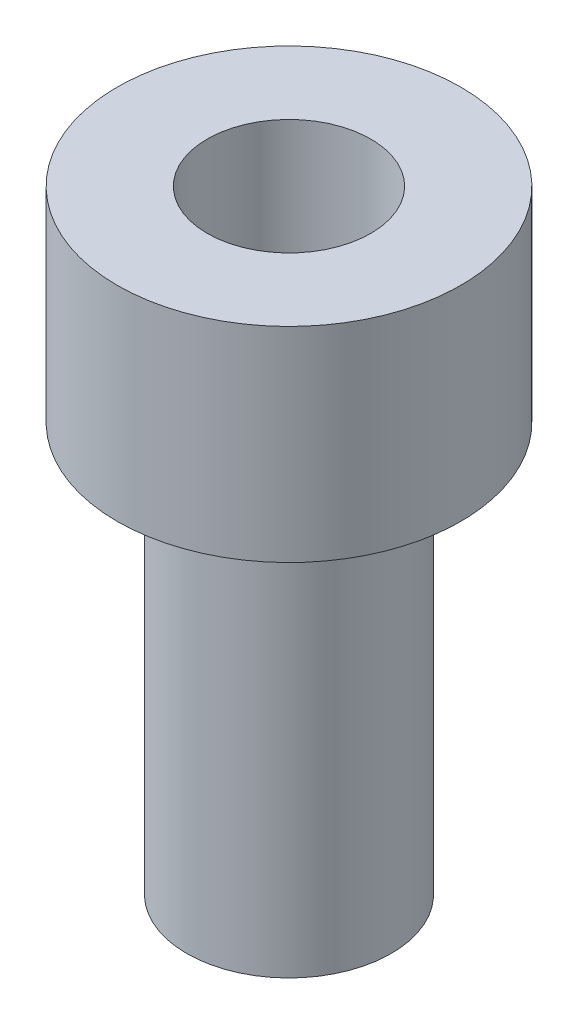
ISO-10303-21;
HEADER;
FILE_DESCRIPTION(('STEP AP214'),'2;1');
FILE_NAME('part.step','',(''),(''),'','','');
FILE_SCHEMA(('AUTOMOTIVE_DESIGN { 1 0 10303 214 1 1 1 1 }'));
ENDSEC;
DATA;
#1=APPLICATION_CONTEXT('core data for automotive mechanical design processes');
#2=APPLICATION_PROTOCOL_DEFINITION('international standard','automotive_design',2000,#1);
#3=PRODUCT_CONTEXT('',#1,'mechanical');
#4=PRODUCT('Part','Part','',(#3));
#5=PRODUCT_RELATED_PRODUCT_CATEGORY('part','',(#4));
#6=PRODUCT_DEFINITION_FORMATION('','',#4);
#7=PRODUCT_DEFINITION_CONTEXT('part definition',#1,'design');
#8=PRODUCT_DEFINITION('design','',#6,#7);
#9=PRODUCT_DEFINITION_SHAPE('','',#8);
#10=(LENGTH_UNIT() NAMED_UNIT(*) SI_UNIT(.MILLI.,.METRE.));
#11=(NAMED_UNIT(*) PLANE_ANGLE_UNIT() SI_UNIT($,.RADIAN.));
#12=(NAMED_UNIT(*) SI_UNIT($,.STERADIAN.) SOLID_ANGLE_UNIT());
#13=UNCERTAINTY_MEASURE_WITH_UNIT(LENGTH_MEASURE(1.E-05),#10,'distance_accuracy_value','');
#14=(GEOMETRIC_REPRESENTATION_CONTEXT(3) GLOBAL_UNCERTAINTY_ASSIGNED_CONTEXT((#13)) GLOBAL_UNIT_ASSIGNED_CONTEXT((#10,
#11,#12)) REPRESENTATION_CONTEXT('',''));
#15=CARTESIAN_POINT('',(0.,0.,0.));
#16=DIRECTION('',(0.,0.,1.));
#17=DIRECTION('',(1.,0.,0.));
#18=AXIS2_PLACEMENT_3D('',#15,#16,#17);
#19=CARTESIAN_POINT('',(0.,12.7,0.));
#20=DIRECTION('',(0.,-1.,0.));
#21=DIRECTION('',(0.,0.,-1.));
#22=AXIS2_PLACEMENT_3D('',#19,#20,#21);
#23=CYLINDRICAL_SURFACE('',#22,3.175);
#24=CARTESIAN_POINT('',(0.,12.7,0.));
#25=DIRECTION('',(0.,1.,0.));
#26=DIRECTION('',(0.,0.,1.));
#27=AXIS2_PLACEMENT_3D('',#24,#25,#26);
#28=CIRCLE('',#27,3.175);
#29=CARTESIAN_POINT('',(0.,12.7,3.175));
#30=VERTEX_POINT('',#29);
#31=EDGE_CURVE('E10',#30,#30,#28,.T.);
#32=ORIENTED_EDGE('',*,*,#31,.F.);
#33=EDGE_LOOP('',(#32));
#34=FACE_BOUND('',#33,.T.);
#35=CARTESIAN_POINT('',(0.,0.,0.));
#36=DIRECTION('',(0.,1.,0.));
#37=DIRECTION('',(0.,0.,1.));
#38=AXIS2_PLACEMENT_3D('',#35,#36,#37);
#39=CIRCLE('',#38,3.175);
#40=CARTESIAN_POINT('',(0.,0.,3.175));
#41=VERTEX_POINT('',#40);
#42=EDGE_CURVE('E35',#41,#41,#39,.T.);
#43=ORIENTED_EDGE('',*,*,#42,.T.);
#44=EDGE_LOOP('',(#43));
#45=FACE_BOUND('',#44,.T.);
#46=ADVANCED_FACE('F29',(#34,#45),#23,.T.);
#47=CARTESIAN_POINT('',(0.,0.,0.));
#48=DIRECTION('',(0.,1.,0.));
#49=DIRECTION('',(0.,0.,1.));
#50=AXIS2_PLACEMENT_3D('',#47,#48,#49);
#51=PLANE('',#50);
#52=ORIENTED_EDGE('',*,*,#42,.F.);
#53=EDGE_LOOP('',(#52));
#54=FACE_BOUND('',#53,.T.);
#55=ADVANCED_FACE('F71',(#54),#51,.F.);
#56=CARTESIAN_POINT('',(0.,12.7,0.));
#57=DIRECTION('',(0.,1.,0.));
#58=DIRECTION('',(0.,0.,1.));
#59=AXIS2_PLACEMENT_3D('',#56,#57,#58);
#60=PLANE('',#59);
#61=CARTESIAN_POINT('',(0.,12.7,0.));
#62=DIRECTION('',(0.,1.,0.));
#63=DIRECTION('',(0.,0.,1.));
#64=AXIS2_PLACEMENT_3D('',#61,#62,#63);
#65=CIRCLE('',#64,5.334);
#66=CARTESIAN_POINT('',(0.,12.7,5.334));
#67=VERTEX_POINT('',#66);
#68=EDGE_CURVE('E43',#67,#67,#65,.T.);
#69=ORIENTED_EDGE('',*,*,#68,.F.);
#70=EDGE_LOOP('',(#69));
#71=FACE_BOUND('',#70,.T.);
#72=ORIENTED_EDGE('',*,*,#31,.T.);
#73=EDGE_LOOP('',(#72));
#74=FACE_BOUND('',#73,.T.);
#75=ADVANCED_FACE('F66',(#71,#74),#60,.F.);
#76=CARTESIAN_POINT('',(0.,19.05,0.));
#77=DIRECTION('',(0.,-1.,0.));
#78=DIRECTION('',(0.,0.,-1.));
#79=AXIS2_PLACEMENT_3D('',#76,#77,#78);
#80=CYLINDRICAL_SURFACE('',#79,5.334);
#81=CARTESIAN_POINT('',(0.,19.05,0.));
#82=DIRECTION('',(0.,1.,0.));
#83=DIRECTION('',(0.,0.,1.));
#84=AXIS2_PLACEMENT_3D('',#81,#82,#83);
#85=CIRCLE('',#84,5.334);
#86=CARTESIAN_POINT('',(0.,19.05,5.334));
#87=VERTEX_POINT('',#86);
#88=EDGE_CURVE('E39',#87,#87,#85,.T.);
#89=ORIENTED_EDGE('',*,*,#88,.F.);
#90=EDGE_LOOP('',(#89));
#91=FACE_BOUND('',#90,.T.);
#92=ORIENTED_EDGE('',*,*,#68,.T.);
#93=EDGE_LOOP('',(#92));
#94=FACE_BOUND('',#93,.T.);
#95=ADVANCED_FACE('F60',(#91,#94),#80,.T.);
#96=CARTESIAN_POINT('',(0.,19.05,0.));
#97=DIRECTION('',(0.,1.,0.));
#98=DIRECTION('',(0.,0.,1.));
#99=AXIS2_PLACEMENT_3D('',#96,#97,#98);
#100=PLANE('',#99);
#101=CARTESIAN_POINT('',(0.,19.05,0.));
#102=DIRECTION('',(0.,1.,0.));
#103=DIRECTION('',(0.,0.,1.));
#104=AXIS2_PLACEMENT_3D('',#101,#102,#103);
#105=CIRCLE('',#104,2.54);
#106=CARTESIAN_POINT('',(0.,19.05,2.54));
#107=VERTEX_POINT('',#106);
#108=EDGE_CURVE('E51',#107,#107,#105,.T.);
#109=ORIENTED_EDGE('',*,*,#108,.F.);
#110=EDGE_LOOP('',(#109));
#111=FACE_BOUND('',#110,.T.);
#112=ORIENTED_EDGE('',*,*,#88,.T.);
#113=EDGE_LOOP('',(#112));
#114=FACE_BOUND('',#113,.T.);
#115=ADVANCED_FACE('F57',(#111,#114),#100,.T.);
#116=CARTESIAN_POINT('',(0.,13.97,0.));
#117=DIRECTION('',(0.,1.,0.));
#118=DIRECTION('',(0.,0.,1.));
#119=AXIS2_PLACEMENT_3D('',#116,#117,#118);
#120=CYLINDRICAL_SURFACE('',#119,2.54);
#121=CARTESIAN_POINT('',(0.,13.97,0.));
#122=DIRECTION('',(0.,1.,0.));
#123=DIRECTION('',(0.,0.,1.));
#124=AXIS2_PLACEMENT_3D('',#121,#122,#123);
#125=CIRCLE('',#124,2.54);
#126=CARTESIAN_POINT('',(0.,13.97,2.54));
#127=VERTEX_POINT('',#126);
#128=EDGE_CURVE('E48',#127,#127,#125,.T.);
#129=ORIENTED_EDGE('',*,*,#128,.F.);
#130=EDGE_LOOP('',(#129));
#131=FACE_BOUND('',#130,.T.);
#132=ORIENTED_EDGE('',*,*,#108,.T.);
#133=EDGE_LOOP('',(#132));
#134=FACE_BOUND('',#133,.T.);
#135=ADVANCED_FACE('F55',(#131,#134),#120,.F.);
#136=CARTESIAN_POINT('',(0.,13.97,0.));
#137=DIRECTION('',(0.,1.,0.));
#138=DIRECTION('',(0.,0.,1.));
#139=AXIS2_PLACEMENT_3D('',#136,#137,#138);
#140=PLANE('',#139);
#141=ORIENTED_EDGE('',*,*,#128,.T.);
#142=EDGE_LOOP('',(#141));
#143=FACE_BOUND('',#142,.T.);
#144=ADVANCED_FACE('F111',(#143),#140,.T.);
#145=CLOSED_SHELL('',(#46,#55,#75,#95,#115,#135,#144));
#146=MANIFOLD_SOLID_BREP('B2',#145);
#147=ADVANCED_BREP_SHAPE_REPRESENTATION('',(#18,#146),#14);
#148=SHAPE_DEFINITION_REPRESENTATION(#9,#147);
ENDSEC;
END-ISO-10303-21;
